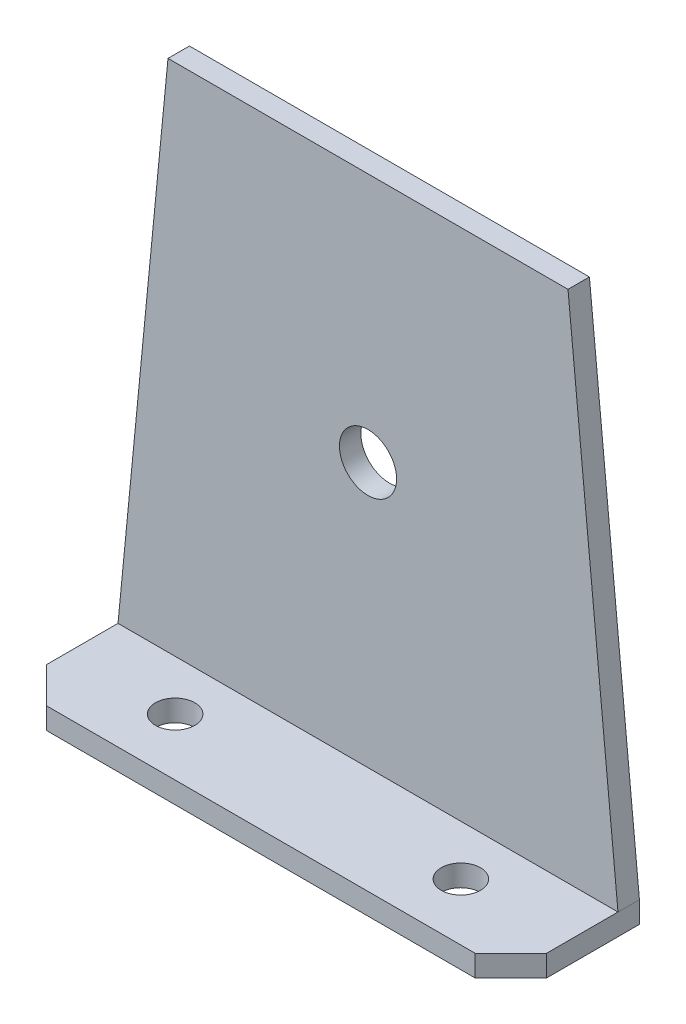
ISO-10303-21;
HEADER;
FILE_DESCRIPTION(('STEP AP214'),'2;1');
FILE_NAME('part.step','',(''),(''),'','','');
FILE_SCHEMA(('AUTOMOTIVE_DESIGN { 1 0 10303 214 1 1 1 1 }'));
ENDSEC;
DATA;
#1=APPLICATION_CONTEXT('core data for automotive mechanical design processes');
#2=APPLICATION_PROTOCOL_DEFINITION('international standard','automotive_design',2000,#1);
#3=PRODUCT_CONTEXT('',#1,'mechanical');
#4=PRODUCT('Part','Part','',(#3));
#5=PRODUCT_RELATED_PRODUCT_CATEGORY('part','',(#4));
#6=PRODUCT_DEFINITION_FORMATION('','',#4);
#7=PRODUCT_DEFINITION_CONTEXT('part definition',#1,'design');
#8=PRODUCT_DEFINITION('design','',#6,#7);
#9=PRODUCT_DEFINITION_SHAPE('','',#8);
#10=(LENGTH_UNIT() NAMED_UNIT(*) SI_UNIT(.MILLI.,.METRE.));
#11=(NAMED_UNIT(*) PLANE_ANGLE_UNIT() SI_UNIT($,.RADIAN.));
#12=(NAMED_UNIT(*) SI_UNIT($,.STERADIAN.) SOLID_ANGLE_UNIT());
#13=UNCERTAINTY_MEASURE_WITH_UNIT(LENGTH_MEASURE(1.E-05),#10,'distance_accuracy_value','');
#14=(GEOMETRIC_REPRESENTATION_CONTEXT(3) GLOBAL_UNCERTAINTY_ASSIGNED_CONTEXT((#13)) GLOBAL_UNIT_ASSIGNED_CONTEXT((#10,
#11,#12)) REPRESENTATION_CONTEXT('',''));
#15=CARTESIAN_POINT('',(0.,0.,0.));
#16=DIRECTION('',(0.,0.,1.));
#17=DIRECTION('',(1.,0.,0.));
#18=AXIS2_PLACEMENT_3D('',#15,#16,#17);
#19=CARTESIAN_POINT('',(70.,0.,0.));
#20=DIRECTION('',(0.,0.,1.));
#21=DIRECTION('',(1.,0.,0.));
#22=AXIS2_PLACEMENT_3D('',#19,#20,#21);
#23=PLANE('',#22);
#24=CARTESIAN_POINT('',(35.,40.,0.));
#25=DIRECTION('',(0.,0.,1.));
#26=DIRECTION('',(1.,0.,0.));
#27=AXIS2_PLACEMENT_3D('',#24,#25,#26);
#28=CIRCLE('',#27,4.00000000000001);
#29=CARTESIAN_POINT('',(39.,40.,0.));
#30=VERTEX_POINT('',#29);
#31=EDGE_CURVE('E120',#30,#30,#28,.T.);
#32=ORIENTED_EDGE('',*,*,#31,.T.);
#33=EDGE_LOOP('',(#32));
#34=FACE_BOUND('',#33,.T.);
#35=DIRECTION('',(-1.,0.,0.));
#36=VECTOR('',#35,1.);
#37=CARTESIAN_POINT('',(70.,75.,0.));
#38=LINE('',#37,#36);
#39=CARTESIAN_POINT('',(63.,75.,0.));
#40=VERTEX_POINT('',#39);
#41=CARTESIAN_POINT('',(7.,75.,0.));
#42=VERTEX_POINT('',#41);
#43=EDGE_CURVE('E126',#40,#42,#38,.T.);
#44=ORIENTED_EDGE('',*,*,#43,.F.);
#45=DIRECTION('',(0.0967659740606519,-0.995307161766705,0.));
#46=VECTOR('',#45,1.);
#47=CARTESIAN_POINT('',(70.2889356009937,0.0280909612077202,0.));
#48=LINE('',#47,#46);
#49=CARTESIAN_POINT('',(70.,3.,0.));
#50=VERTEX_POINT('',#49);
#51=EDGE_CURVE('E106',#40,#50,#48,.T.);
#52=ORIENTED_EDGE('',*,*,#51,.T.);
#53=DIRECTION('',(0.,1.,0.));
#54=VECTOR('',#53,1.);
#55=CARTESIAN_POINT('',(70.,0.,0.));
#56=LINE('',#55,#54);
#57=CARTESIAN_POINT('',(70.,0.,0.));
#58=VERTEX_POINT('',#57);
#59=EDGE_CURVE('E171',#58,#50,#56,.T.);
#60=ORIENTED_EDGE('',*,*,#59,.F.);
#61=DIRECTION('',(-1.,0.,0.));
#62=VECTOR('',#61,1.);
#63=CARTESIAN_POINT('',(70.,0.,0.));
#64=LINE('',#63,#62);
#65=CARTESIAN_POINT('',(0.,0.,0.));
#66=VERTEX_POINT('',#65);
#67=EDGE_CURVE('E183',#58,#66,#64,.T.);
#68=ORIENTED_EDGE('',*,*,#67,.T.);
#69=DIRECTION('',(0.,1.,0.));
#70=VECTOR('',#69,1.);
#71=CARTESIAN_POINT('',(0.,0.,0.));
#72=LINE('',#71,#70);
#73=CARTESIAN_POINT('',(0.,2.99999999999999,0.));
#74=VERTEX_POINT('',#73);
#75=EDGE_CURVE('E194',#66,#74,#72,.T.);
#76=ORIENTED_EDGE('',*,*,#75,.T.);
#77=DIRECTION('',(0.0967659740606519,0.995307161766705,0.));
#78=VECTOR('',#77,1.);
#79=CARTESIAN_POINT('',(0.366520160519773,6.76992165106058,0.));
#80=LINE('',#79,#78);
#81=EDGE_CURVE('E197',#74,#42,#80,.T.);
#82=ORIENTED_EDGE('',*,*,#81,.T.);
#83=EDGE_LOOP('',(#44,#52,#60,#68,#76,#82));
#84=FACE_BOUND('',#83,.T.);
#85=ADVANCED_FACE('F30',(#34,#84),#23,.F.);
#86=CARTESIAN_POINT('',(70.,75.,0.));
#87=DIRECTION('',(0.,-1.,0.));
#88=DIRECTION('',(0.,0.,-1.));
#89=AXIS2_PLACEMENT_3D('',#86,#87,#88);
#90=PLANE('',#89);
#91=DIRECTION('',(-1.,0.,0.));
#92=VECTOR('',#91,1.);
#93=CARTESIAN_POINT('',(70.,75.,3.));
#94=LINE('',#93,#92);
#95=CARTESIAN_POINT('',(63.,75.,3.));
#96=VERTEX_POINT('',#95);
#97=CARTESIAN_POINT('',(7.,75.,3.));
#98=VERTEX_POINT('',#97);
#99=EDGE_CURVE('E115',#96,#98,#94,.T.);
#100=ORIENTED_EDGE('',*,*,#99,.F.);
#101=DIRECTION('',(0.,0.,1.));
#102=VECTOR('',#101,1.);
#103=CARTESIAN_POINT('',(63.,75.,-67.));
#104=LINE('',#103,#102);
#105=EDGE_CURVE('E100',#40,#96,#104,.T.);
#106=ORIENTED_EDGE('',*,*,#105,.F.);
#107=ORIENTED_EDGE('',*,*,#43,.T.);
#108=DIRECTION('',(0.,0.,1.));
#109=VECTOR('',#108,1.);
#110=CARTESIAN_POINT('',(7.,75.,-67.));
#111=LINE('',#110,#109);
#112=EDGE_CURVE('E125',#42,#98,#111,.T.);
#113=ORIENTED_EDGE('',*,*,#112,.T.);
#114=EDGE_LOOP('',(#100,#106,#107,#113));
#115=FACE_BOUND('',#114,.T.);
#116=ADVANCED_FACE('F123',(#115),#90,.F.);
#117=CARTESIAN_POINT('',(70.,3.,3.));
#118=DIRECTION('',(0.,0.,-1.));
#119=DIRECTION('',(-1.,0.,0.));
#120=AXIS2_PLACEMENT_3D('',#117,#118,#119);
#121=PLANE('',#120);
#122=CARTESIAN_POINT('',(35.,40.,3.));
#123=DIRECTION('',(0.,0.,1.));
#124=DIRECTION('',(1.,0.,0.));
#125=AXIS2_PLACEMENT_3D('',#122,#123,#124);
#126=CIRCLE('',#125,4.00000000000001);
#127=CARTESIAN_POINT('',(39.,40.,3.));
#128=VERTEX_POINT('',#127);
#129=EDGE_CURVE('E142',#128,#128,#126,.T.);
#130=ORIENTED_EDGE('',*,*,#129,.F.);
#131=EDGE_LOOP('',(#130));
#132=FACE_BOUND('',#131,.T.);
#133=DIRECTION('',(-1.,0.,0.));
#134=VECTOR('',#133,1.);
#135=CARTESIAN_POINT('',(70.,3.,3.));
#136=LINE('',#135,#134);
#137=CARTESIAN_POINT('',(70.,3.,3.));
#138=VERTEX_POINT('',#137);
#139=CARTESIAN_POINT('',(0.,3.,3.));
#140=VERTEX_POINT('',#139);
#141=EDGE_CURVE('E118',#138,#140,#136,.T.);
#142=ORIENTED_EDGE('',*,*,#141,.F.);
#143=DIRECTION('',(0.0967659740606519,-0.995307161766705,0.));
#144=VECTOR('',#143,1.);
#145=CARTESIAN_POINT('',(63.,75.,3.));
#146=LINE('',#145,#144);
#147=EDGE_CURVE('E103',#96,#138,#146,.T.);
#148=ORIENTED_EDGE('',*,*,#147,.F.);
#149=ORIENTED_EDGE('',*,*,#99,.T.);
#150=DIRECTION('',(0.0967659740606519,0.995307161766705,0.));
#151=VECTOR('',#150,1.);
#152=CARTESIAN_POINT('',(7.,75.,3.));
#153=LINE('',#152,#151);
#154=EDGE_CURVE('E201',#140,#98,#153,.T.);
#155=ORIENTED_EDGE('',*,*,#154,.F.);
#156=EDGE_LOOP('',(#142,#148,#149,#155));
#157=FACE_BOUND('',#156,.T.);
#158=ADVANCED_FACE('F113',(#132,#157),#121,.F.);
#159=CARTESIAN_POINT('',(70.,3.,3.));
#160=DIRECTION('',(0.,-1.,0.));
#161=DIRECTION('',(0.,0.,-1.));
#162=AXIS2_PLACEMENT_3D('',#159,#160,#161);
#163=PLANE('',#162);
#164=CARTESIAN_POINT('',(15.,3.,10.));
#165=DIRECTION('',(0.,1.,0.));
#166=DIRECTION('',(0.,0.,1.));
#167=AXIS2_PLACEMENT_3D('',#164,#165,#166);
#168=CIRCLE('',#167,2.75);
#169=CARTESIAN_POINT('',(15.,3.,12.75));
#170=VERTEX_POINT('',#169);
#171=EDGE_CURVE('E147',#170,#170,#168,.T.);
#172=ORIENTED_EDGE('',*,*,#171,.F.);
#173=EDGE_LOOP('',(#172));
#174=FACE_BOUND('',#173,.T.);
#175=CARTESIAN_POINT('',(55.,3.,10.));
#176=DIRECTION('',(0.,1.,0.));
#177=DIRECTION('',(0.,0.,1.));
#178=AXIS2_PLACEMENT_3D('',#175,#176,#177);
#179=CIRCLE('',#178,2.75);
#180=CARTESIAN_POINT('',(55.,3.,12.75));
#181=VERTEX_POINT('',#180);
#182=EDGE_CURVE('E143',#181,#181,#179,.T.);
#183=ORIENTED_EDGE('',*,*,#182,.F.);
#184=EDGE_LOOP('',(#183));
#185=FACE_BOUND('',#184,.T.);
#186=DIRECTION('',(-1.,0.,0.));
#187=VECTOR('',#186,1.);
#188=CARTESIAN_POINT('',(70.,3.,18.));
#189=LINE('',#188,#187);
#190=CARTESIAN_POINT('',(65.,3.,18.));
#191=VERTEX_POINT('',#190);
#192=CARTESIAN_POINT('',(5.00000000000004,3.,18.));
#193=VERTEX_POINT('',#192);
#194=EDGE_CURVE('E130',#191,#193,#189,.T.);
#195=ORIENTED_EDGE('',*,*,#194,.F.);
#196=DIRECTION('',(0.707106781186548,0.,-0.707106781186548));
#197=VECTOR('',#196,1.);
#198=CARTESIAN_POINT('',(70.,3.,13.));
#199=LINE('',#198,#197);
#200=CARTESIAN_POINT('',(70.,3.,13.));
#201=VERTEX_POINT('',#200);
#202=EDGE_CURVE('E37',#191,#201,#199,.T.);
#203=ORIENTED_EDGE('',*,*,#202,.T.);
#204=DIRECTION('',(0.,0.,1.));
#205=VECTOR('',#204,1.);
#206=CARTESIAN_POINT('',(70.,3.,3.));
#207=LINE('',#206,#205);
#208=EDGE_CURVE('E162',#138,#201,#207,.T.);
#209=ORIENTED_EDGE('',*,*,#208,.F.);
#210=ORIENTED_EDGE('',*,*,#141,.T.);
#211=DIRECTION('',(0.,0.,1.));
#212=VECTOR('',#211,1.);
#213=CARTESIAN_POINT('',(0.,3.,3.));
#214=LINE('',#213,#212);
#215=CARTESIAN_POINT('',(0.,3.,13.));
#216=VERTEX_POINT('',#215);
#217=EDGE_CURVE('E192',#140,#216,#214,.T.);
#218=ORIENTED_EDGE('',*,*,#217,.T.);
#219=DIRECTION('',(-0.707106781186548,0.,-0.707106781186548));
#220=VECTOR('',#219,1.);
#221=CARTESIAN_POINT('',(5.00000000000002,3.,18.));
#222=LINE('',#221,#220);
#223=EDGE_CURVE('E49',#216,#193,#222,.F.);
#224=ORIENTED_EDGE('',*,*,#223,.T.);
#225=EDGE_LOOP('',(#195,#203,#209,#210,#218,#224));
#226=FACE_BOUND('',#225,.T.);
#227=ADVANCED_FACE('F161',(#174,#185,#226),#163,.F.);
#228=CARTESIAN_POINT('',(70.,3.,18.));
#229=DIRECTION('',(0.,0.,-1.));
#230=DIRECTION('',(-1.,0.,0.));
#231=AXIS2_PLACEMENT_3D('',#228,#229,#230);
#232=PLANE('',#231);
#233=DIRECTION('',(-1.,0.,0.));
#234=VECTOR('',#233,1.);
#235=CARTESIAN_POINT('',(70.,0.,18.));
#236=LINE('',#235,#234);
#237=CARTESIAN_POINT('',(65.,0.,18.));
#238=VERTEX_POINT('',#237);
#239=CARTESIAN_POINT('',(5.00000000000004,0.,18.));
#240=VERTEX_POINT('',#239);
#241=EDGE_CURVE('E178',#238,#240,#236,.T.);
#242=ORIENTED_EDGE('',*,*,#241,.F.);
#243=DIRECTION('',(0.,1.,0.));
#244=VECTOR('',#243,1.);
#245=CARTESIAN_POINT('',(65.,3.,18.));
#246=LINE('',#245,#244);
#247=EDGE_CURVE('E157',#238,#191,#246,.T.);
#248=ORIENTED_EDGE('',*,*,#247,.T.);
#249=ORIENTED_EDGE('',*,*,#194,.T.);
#250=DIRECTION('',(0.,-1.,0.));
#251=VECTOR('',#250,1.);
#252=CARTESIAN_POINT('',(5.00000000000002,3.,18.));
#253=LINE('',#252,#251);
#254=EDGE_CURVE('E154',#193,#240,#253,.T.);
#255=ORIENTED_EDGE('',*,*,#254,.T.);
#256=EDGE_LOOP('',(#242,#248,#249,#255));
#257=FACE_BOUND('',#256,.T.);
#258=ADVANCED_FACE('F181',(#257),#232,.F.);
#259=CARTESIAN_POINT('',(70.,0.,0.));
#260=DIRECTION('',(0.,1.,0.));
#261=DIRECTION('',(0.,0.,1.));
#262=AXIS2_PLACEMENT_3D('',#259,#260,#261);
#263=PLANE('',#262);
#264=CARTESIAN_POINT('',(15.,0.,10.));
#265=DIRECTION('',(0.,1.,0.));
#266=DIRECTION('',(0.,0.,1.));
#267=AXIS2_PLACEMENT_3D('',#264,#265,#266);
#268=CIRCLE('',#267,2.75);
#269=CARTESIAN_POINT('',(15.,0.,12.75));
#270=VERTEX_POINT('',#269);
#271=EDGE_CURVE('E144',#270,#270,#268,.T.);
#272=ORIENTED_EDGE('',*,*,#271,.T.);
#273=EDGE_LOOP('',(#272));
#274=FACE_BOUND('',#273,.T.);
#275=CARTESIAN_POINT('',(55.,0.,10.));
#276=DIRECTION('',(0.,1.,0.));
#277=DIRECTION('',(0.,0.,1.));
#278=AXIS2_PLACEMENT_3D('',#275,#276,#277);
#279=CIRCLE('',#278,2.75);
#280=CARTESIAN_POINT('',(55.,0.,12.75));
#281=VERTEX_POINT('',#280);
#282=EDGE_CURVE('E139',#281,#281,#279,.T.);
#283=ORIENTED_EDGE('',*,*,#282,.T.);
#284=EDGE_LOOP('',(#283));
#285=FACE_BOUND('',#284,.T.);
#286=DIRECTION('',(0.,0.,-1.));
#287=VECTOR('',#286,1.);
#288=CARTESIAN_POINT('',(70.,0.,0.));
#289=LINE('',#288,#287);
#290=CARTESIAN_POINT('',(70.,0.,13.));
#291=VERTEX_POINT('',#290);
#292=EDGE_CURVE('E170',#291,#58,#289,.T.);
#293=ORIENTED_EDGE('',*,*,#292,.F.);
#294=DIRECTION('',(-0.707106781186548,0.,0.707106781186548));
#295=VECTOR('',#294,1.);
#296=CARTESIAN_POINT('',(70.,0.,13.));
#297=LINE('',#296,#295);
#298=EDGE_CURVE('E152',#291,#238,#297,.T.);
#299=ORIENTED_EDGE('',*,*,#298,.T.);
#300=ORIENTED_EDGE('',*,*,#241,.T.);
#301=DIRECTION('',(0.707106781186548,0.,0.707106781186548));
#302=VECTOR('',#301,1.);
#303=CARTESIAN_POINT('',(5.00000000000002,0.,18.));
#304=LINE('',#303,#302);
#305=CARTESIAN_POINT('',(0.,0.,13.));
#306=VERTEX_POINT('',#305);
#307=EDGE_CURVE('E150',#240,#306,#304,.F.);
#308=ORIENTED_EDGE('',*,*,#307,.T.);
#309=DIRECTION('',(0.,0.,-1.));
#310=VECTOR('',#309,1.);
#311=CARTESIAN_POINT('',(0.,0.,0.));
#312=LINE('',#311,#310);
#313=EDGE_CURVE('E190',#306,#66,#312,.T.);
#314=ORIENTED_EDGE('',*,*,#313,.T.);
#315=ORIENTED_EDGE('',*,*,#67,.F.);
#316=EDGE_LOOP('',(#293,#299,#300,#308,#314,#315));
#317=FACE_BOUND('',#316,.T.);
#318=ADVANCED_FACE('F177',(#274,#285,#317),#263,.F.);
#319=CARTESIAN_POINT('',(70.,75.,0.));
#320=DIRECTION('',(1.,0.,0.));
#321=DIRECTION('',(0.,0.,-1.));
#322=AXIS2_PLACEMENT_3D('',#319,#320,#321);
#323=PLANE('',#322);
#324=ORIENTED_EDGE('',*,*,#208,.T.);
#325=DIRECTION('',(0.,-1.,0.));
#326=VECTOR('',#325,1.);
#327=CARTESIAN_POINT('',(70.,0.,13.));
#328=LINE('',#327,#326);
#329=EDGE_CURVE('E138',#201,#291,#328,.T.);
#330=ORIENTED_EDGE('',*,*,#329,.T.);
#331=ORIENTED_EDGE('',*,*,#292,.T.);
#332=ORIENTED_EDGE('',*,*,#59,.T.);
#333=DIRECTION('',(0.,0.,-1.));
#334=VECTOR('',#333,1.);
#335=CARTESIAN_POINT('',(70.,3.,0.));
#336=LINE('',#335,#334);
#337=EDGE_CURVE('E136',#138,#50,#336,.T.);
#338=ORIENTED_EDGE('',*,*,#337,.F.);
#339=EDGE_LOOP('',(#324,#330,#331,#332,#338));
#340=FACE_BOUND('',#339,.T.);
#341=ADVANCED_FACE('F167',(#340),#323,.T.);
#342=CARTESIAN_POINT('',(0.,75.,0.));
#343=DIRECTION('',(1.,0.,0.));
#344=DIRECTION('',(0.,0.,-1.));
#345=AXIS2_PLACEMENT_3D('',#342,#343,#344);
#346=PLANE('',#345);
#347=ORIENTED_EDGE('',*,*,#313,.F.);
#348=DIRECTION('',(0.,1.,0.));
#349=VECTOR('',#348,1.);
#350=CARTESIAN_POINT('',(0.,75.,13.));
#351=LINE('',#350,#349);
#352=EDGE_CURVE('E11',#306,#216,#351,.T.);
#353=ORIENTED_EDGE('',*,*,#352,.T.);
#354=ORIENTED_EDGE('',*,*,#217,.F.);
#355=DIRECTION('',(0.,0.,-1.));
#356=VECTOR('',#355,1.);
#357=CARTESIAN_POINT('',(0.,2.99999999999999,0.));
#358=LINE('',#357,#356);
#359=EDGE_CURVE('E128',#140,#74,#358,.T.);
#360=ORIENTED_EDGE('',*,*,#359,.T.);
#361=ORIENTED_EDGE('',*,*,#75,.F.);
#362=EDGE_LOOP('',(#347,#353,#354,#360,#361));
#363=FACE_BOUND('',#362,.T.);
#364=ADVANCED_FACE('F235',(#363),#346,.F.);
#365=CARTESIAN_POINT('',(7.,75.,-67.));
#366=DIRECTION('',(0.995307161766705,-0.0967659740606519,0.));
#367=DIRECTION('',(0.0967659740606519,0.995307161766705,0.));
#368=AXIS2_PLACEMENT_3D('',#365,#366,#367);
#369=PLANE('',#368);
#370=ORIENTED_EDGE('',*,*,#359,.F.);
#371=ORIENTED_EDGE('',*,*,#154,.T.);
#372=ORIENTED_EDGE('',*,*,#112,.F.);
#373=ORIENTED_EDGE('',*,*,#81,.F.);
#374=EDGE_LOOP('',(#370,#371,#372,#373));
#375=FACE_BOUND('',#374,.T.);
#376=ADVANCED_FACE('F247',(#375),#369,.F.);
#377=CARTESIAN_POINT('',(63.,75.,-67.));
#378=DIRECTION('',(-0.995307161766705,-0.0967659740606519,0.));
#379=DIRECTION('',(0.0967659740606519,-0.995307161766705,0.));
#380=AXIS2_PLACEMENT_3D('',#377,#378,#379);
#381=PLANE('',#380);
#382=ORIENTED_EDGE('',*,*,#105,.T.);
#383=ORIENTED_EDGE('',*,*,#147,.T.);
#384=ORIENTED_EDGE('',*,*,#337,.T.);
#385=ORIENTED_EDGE('',*,*,#51,.F.);
#386=EDGE_LOOP('',(#382,#383,#384,#385));
#387=FACE_BOUND('',#386,.T.);
#388=ADVANCED_FACE('F102',(#387),#381,.F.);
#389=CARTESIAN_POINT('',(35.,40.,-67.));
#390=DIRECTION('',(0.,0.,1.));
#391=DIRECTION('',(1.,0.,0.));
#392=AXIS2_PLACEMENT_3D('',#389,#390,#391);
#393=CYLINDRICAL_SURFACE('',#392,4.00000000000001);
#394=ORIENTED_EDGE('',*,*,#129,.T.);
#395=EDGE_LOOP('',(#394));
#396=FACE_BOUND('',#395,.T.);
#397=ORIENTED_EDGE('',*,*,#31,.F.);
#398=EDGE_LOOP('',(#397));
#399=FACE_BOUND('',#398,.T.);
#400=ADVANCED_FACE('F224',(#396,#399),#393,.F.);
#401=CARTESIAN_POINT('',(55.,-67.,10.));
#402=DIRECTION('',(0.,1.,0.));
#403=DIRECTION('',(0.,0.,1.));
#404=AXIS2_PLACEMENT_3D('',#401,#402,#403);
#405=CYLINDRICAL_SURFACE('',#404,2.75);
#406=ORIENTED_EDGE('',*,*,#182,.T.);
#407=EDGE_LOOP('',(#406));
#408=FACE_BOUND('',#407,.T.);
#409=ORIENTED_EDGE('',*,*,#282,.F.);
#410=EDGE_LOOP('',(#409));
#411=FACE_BOUND('',#410,.T.);
#412=ADVANCED_FACE('F221',(#408,#411),#405,.F.);
#413=CARTESIAN_POINT('',(15.,-67.,10.));
#414=DIRECTION('',(0.,1.,0.));
#415=DIRECTION('',(0.,0.,1.));
#416=AXIS2_PLACEMENT_3D('',#413,#414,#415);
#417=CYLINDRICAL_SURFACE('',#416,2.75);
#418=ORIENTED_EDGE('',*,*,#171,.T.);
#419=EDGE_LOOP('',(#418));
#420=FACE_BOUND('',#419,.T.);
#421=ORIENTED_EDGE('',*,*,#271,.F.);
#422=EDGE_LOOP('',(#421));
#423=FACE_BOUND('',#422,.T.);
#424=ADVANCED_FACE('F213',(#420,#423),#417,.F.);
#425=CARTESIAN_POINT('',(70.,75.,13.));
#426=DIRECTION('',(0.707106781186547,0.,0.707106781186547));
#427=DIRECTION('',(0.707106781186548,0.,-0.707106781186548));
#428=AXIS2_PLACEMENT_3D('',#425,#426,#427);
#429=PLANE('',#428);
#430=ORIENTED_EDGE('',*,*,#202,.F.);
#431=ORIENTED_EDGE('',*,*,#247,.F.);
#432=ORIENTED_EDGE('',*,*,#298,.F.);
#433=ORIENTED_EDGE('',*,*,#329,.F.);
#434=EDGE_LOOP('',(#430,#431,#432,#433));
#435=FACE_BOUND('',#434,.T.);
#436=ADVANCED_FACE('F173',(#435),#429,.T.);
#437=CARTESIAN_POINT('',(5.00000000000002,3.,18.));
#438=DIRECTION('',(0.707106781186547,0.,-0.707106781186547));
#439=DIRECTION('',(-0.707106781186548,0.,-0.707106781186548));
#440=AXIS2_PLACEMENT_3D('',#437,#438,#439);
#441=PLANE('',#440);
#442=ORIENTED_EDGE('',*,*,#223,.F.);
#443=ORIENTED_EDGE('',*,*,#352,.F.);
#444=ORIENTED_EDGE('',*,*,#307,.F.);
#445=ORIENTED_EDGE('',*,*,#254,.F.);
#446=EDGE_LOOP('',(#442,#443,#444,#445));
#447=FACE_BOUND('',#446,.T.);
#448=ADVANCED_FACE('F250',(#447),#441,.F.);
#449=CLOSED_SHELL('',(#85,#116,#158,#227,#258,#318,#341,#364,#376,#388,#400,#412,#424,#436,#448));
#450=MANIFOLD_SOLID_BREP('B2',#449);
#451=ADVANCED_BREP_SHAPE_REPRESENTATION('',(#18,#450),#14);
#452=SHAPE_DEFINITION_REPRESENTATION(#9,#451);
ENDSEC;
END-ISO-10303-21;
